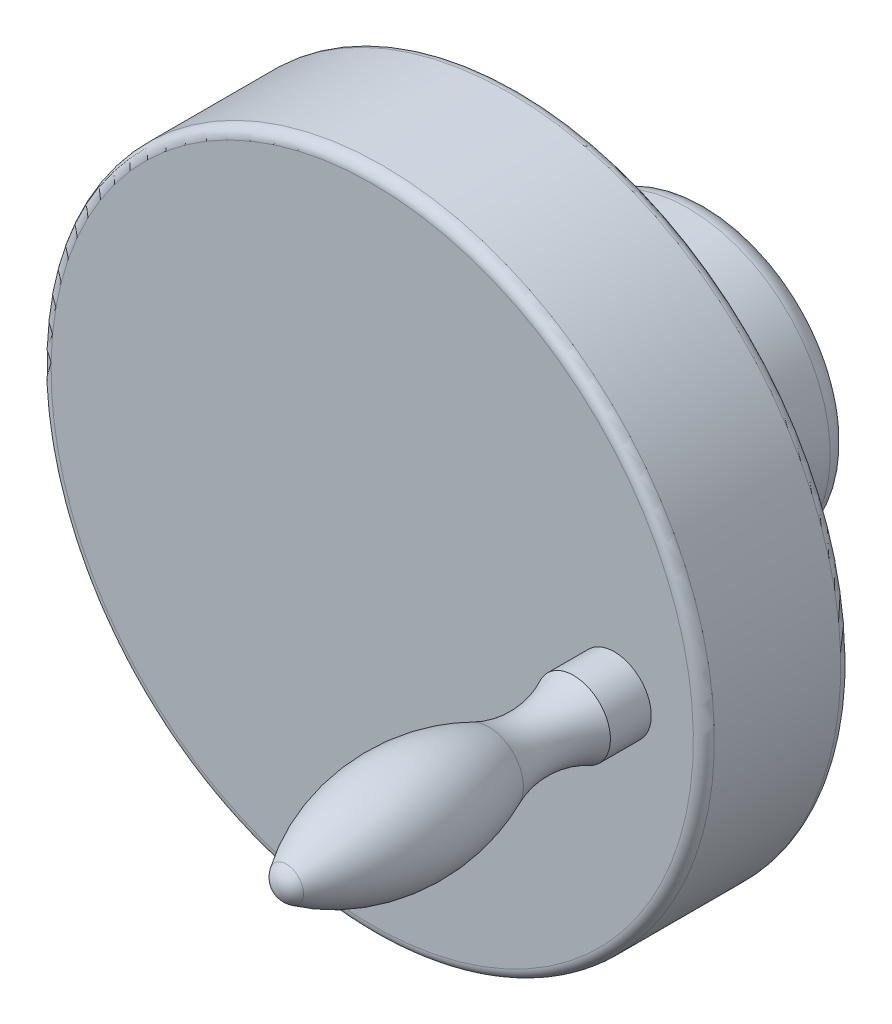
ISO-10303-21;
HEADER;
FILE_DESCRIPTION(('STEP AP214'),'2;1');
FILE_NAME('part.step','',(''),(''),'','','');
FILE_SCHEMA(('AUTOMOTIVE_DESIGN { 1 0 10303 214 1 1 1 1 }'));
ENDSEC;
DATA;
#1=APPLICATION_CONTEXT('core data for automotive mechanical design processes');
#2=APPLICATION_PROTOCOL_DEFINITION('international standard','automotive_design',2000,#1);
#3=PRODUCT_CONTEXT('',#1,'mechanical');
#4=PRODUCT('Part','Part','',(#3));
#5=PRODUCT_RELATED_PRODUCT_CATEGORY('part','',(#4));
#6=PRODUCT_DEFINITION_FORMATION('','',#4);
#7=PRODUCT_DEFINITION_CONTEXT('part definition',#1,'design');
#8=PRODUCT_DEFINITION('design','',#6,#7);
#9=PRODUCT_DEFINITION_SHAPE('','',#8);
#10=(LENGTH_UNIT() NAMED_UNIT(*) SI_UNIT(.MILLI.,.METRE.));
#11=(NAMED_UNIT(*) PLANE_ANGLE_UNIT() SI_UNIT($,.RADIAN.));
#12=(NAMED_UNIT(*) SI_UNIT($,.STERADIAN.) SOLID_ANGLE_UNIT());
#13=UNCERTAINTY_MEASURE_WITH_UNIT(LENGTH_MEASURE(1.E-05),#10,'distance_accuracy_value','');
#14=(GEOMETRIC_REPRESENTATION_CONTEXT(3) GLOBAL_UNCERTAINTY_ASSIGNED_CONTEXT((#13)) GLOBAL_UNIT_ASSIGNED_CONTEXT((#10,
#11,#12)) REPRESENTATION_CONTEXT('',''));
#15=CARTESIAN_POINT('',(0.,0.,0.));
#16=DIRECTION('',(0.,0.,1.));
#17=DIRECTION('',(1.,0.,0.));
#18=AXIS2_PLACEMENT_3D('',#15,#16,#17);
#19=CARTESIAN_POINT('',(0.,0.,32.));
#20=DIRECTION('',(0.,0.,1.));
#21=DIRECTION('',(0.,1.,0.));
#22=AXIS2_PLACEMENT_3D('',#19,#20,#21);
#23=PLANE('',#22);
#24=CARTESIAN_POINT('',(23.,0.,32.));
#25=DIRECTION('',(0.,0.,1.));
#26=DIRECTION('',(0.,1.,0.));
#27=AXIS2_PLACEMENT_3D('',#24,#25,#26);
#28=CIRCLE('',#27,3.50179345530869);
#29=CARTESIAN_POINT('',(23.,3.50179345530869,32.));
#30=VERTEX_POINT('',#29);
#31=EDGE_CURVE('E8',#30,#30,#28,.T.);
#32=ORIENTED_EDGE('',*,*,#31,.F.);
#33=EDGE_LOOP('',(#32));
#34=FACE_BOUND('',#33,.T.);
#35=CARTESIAN_POINT('',(0.,0.,32.));
#36=DIRECTION('',(0.,0.,1.));
#37=DIRECTION('',(0.,1.,0.));
#38=AXIS2_PLACEMENT_3D('',#35,#36,#37);
#39=CIRCLE('',#38,30.5);
#40=CARTESIAN_POINT('',(0.,30.5,32.));
#41=VERTEX_POINT('',#40);
#42=EDGE_CURVE('E18',#41,#41,#39,.T.);
#43=ORIENTED_EDGE('',*,*,#42,.T.);
#44=EDGE_LOOP('',(#43));
#45=FACE_BOUND('',#44,.T.);
#46=ADVANCED_FACE('F12',(#34,#45),#23,.T.);
#47=CARTESIAN_POINT('',(0.,0.,31.));
#48=DIRECTION('',(0.,0.,1.));
#49=DIRECTION('',(0.,1.,0.));
#50=AXIS2_PLACEMENT_3D('',#47,#48,#49);
#51=TOROIDAL_SURFACE('',#50,30.5,1.);
#52=CARTESIAN_POINT('',(0.,0.,31.));
#53=DIRECTION('',(0.,0.,1.));
#54=DIRECTION('',(0.,1.,0.));
#55=AXIS2_PLACEMENT_3D('',#52,#53,#54);
#56=CIRCLE('',#55,31.5);
#57=CARTESIAN_POINT('',(0.,31.5,31.));
#58=VERTEX_POINT('',#57);
#59=EDGE_CURVE('E22',#58,#58,#56,.T.);
#60=ORIENTED_EDGE('',*,*,#59,.T.);
#61=EDGE_LOOP('',(#60));
#62=FACE_BOUND('',#61,.T.);
#63=ORIENTED_EDGE('',*,*,#42,.F.);
#64=EDGE_LOOP('',(#63));
#65=FACE_BOUND('',#64,.T.);
#66=ADVANCED_FACE('F83',(#62,#65),#51,.T.);
#67=CARTESIAN_POINT('',(0.,0.,37.));
#68=DIRECTION('',(0.,0.,1.));
#69=DIRECTION('',(0.,1.,0.));
#70=AXIS2_PLACEMENT_3D('',#67,#68,#69);
#71=CYLINDRICAL_SURFACE('',#70,31.5);
#72=CARTESIAN_POINT('',(0.,0.,19.));
#73=DIRECTION('',(0.,0.,1.));
#74=DIRECTION('',(0.,1.,0.));
#75=AXIS2_PLACEMENT_3D('',#72,#73,#74);
#76=CIRCLE('',#75,31.5);
#77=CARTESIAN_POINT('',(0.,31.5,19.));
#78=VERTEX_POINT('',#77);
#79=EDGE_CURVE('E26',#78,#78,#76,.T.);
#80=ORIENTED_EDGE('',*,*,#79,.T.);
#81=EDGE_LOOP('',(#80));
#82=FACE_BOUND('',#81,.T.);
#83=ORIENTED_EDGE('',*,*,#59,.F.);
#84=EDGE_LOOP('',(#83));
#85=FACE_BOUND('',#84,.T.);
#86=ADVANCED_FACE('F88',(#82,#85),#71,.T.);
#87=CARTESIAN_POINT('',(0.,0.,19.));
#88=DIRECTION('',(0.,0.,1.));
#89=DIRECTION('',(0.,1.,0.));
#90=AXIS2_PLACEMENT_3D('',#87,#88,#89);
#91=TOROIDAL_SURFACE('',#90,30.5,1.00000000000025);
#92=CARTESIAN_POINT('',(0.,0.,18.));
#93=DIRECTION('',(0.,0.,1.));
#94=DIRECTION('',(0.,1.,0.));
#95=AXIS2_PLACEMENT_3D('',#92,#93,#94);
#96=CIRCLE('',#95,30.500001);
#97=CARTESIAN_POINT('',(0.,30.500001,18.));
#98=VERTEX_POINT('',#97);
#99=EDGE_CURVE('E31',#98,#98,#96,.T.);
#100=ORIENTED_EDGE('',*,*,#99,.T.);
#101=EDGE_LOOP('',(#100));
#102=FACE_BOUND('',#101,.T.);
#103=ORIENTED_EDGE('',*,*,#79,.F.);
#104=EDGE_LOOP('',(#103));
#105=FACE_BOUND('',#104,.T.);
#106=ADVANCED_FACE('F93',(#102,#105),#91,.T.);
#107=CARTESIAN_POINT('',(16.5,0.,18.));
#108=DIRECTION('',(0.,0.,1.));
#109=DIRECTION('',(0.,1.,0.));
#110=AXIS2_PLACEMENT_3D('',#107,#108,#109);
#111=PLANE('',#110);
#112=ORIENTED_EDGE('',*,*,#99,.F.);
#113=EDGE_LOOP('',(#112));
#114=FACE_BOUND('',#113,.T.);
#115=CARTESIAN_POINT('',(0.,0.,18.));
#116=DIRECTION('',(0.,0.,1.));
#117=DIRECTION('',(0.,1.,0.));
#118=AXIS2_PLACEMENT_3D('',#115,#116,#117);
#119=CIRCLE('',#118,16.5);
#120=CARTESIAN_POINT('',(0.,16.5,18.));
#121=VERTEX_POINT('',#120);
#122=EDGE_CURVE('E34',#121,#121,#119,.T.);
#123=ORIENTED_EDGE('',*,*,#122,.T.);
#124=EDGE_LOOP('',(#123));
#125=FACE_BOUND('',#124,.T.);
#126=ADVANCED_FACE('F100',(#114,#125),#111,.F.);
#127=CARTESIAN_POINT('',(0.,0.,15.));
#128=DIRECTION('',(0.,0.,1.));
#129=DIRECTION('',(0.,1.,0.));
#130=AXIS2_PLACEMENT_3D('',#127,#128,#129);
#131=TOROIDAL_SURFACE('',#130,16.5,3.);
#132=ORIENTED_EDGE('',*,*,#122,.F.);
#133=EDGE_LOOP('',(#132));
#134=FACE_BOUND('',#133,.T.);
#135=CARTESIAN_POINT('',(0.,0.,15.));
#136=DIRECTION('',(0.,0.,1.));
#137=DIRECTION('',(0.,1.,0.));
#138=AXIS2_PLACEMENT_3D('',#135,#136,#137);
#139=CIRCLE('',#138,13.5);
#140=CARTESIAN_POINT('',(0.,13.5,15.));
#141=VERTEX_POINT('',#140);
#142=EDGE_CURVE('E37',#141,#141,#139,.T.);
#143=ORIENTED_EDGE('',*,*,#142,.T.);
#144=EDGE_LOOP('',(#143));
#145=FACE_BOUND('',#144,.T.);
#146=ADVANCED_FACE('F104',(#134,#145),#131,.F.);
#147=CARTESIAN_POINT('',(0.,0.,37.));
#148=DIRECTION('',(0.,0.,1.));
#149=DIRECTION('',(0.,1.,0.));
#150=AXIS2_PLACEMENT_3D('',#147,#148,#149);
#151=CYLINDRICAL_SURFACE('',#150,13.5);
#152=CARTESIAN_POINT('',(0.,0.,2.));
#153=DIRECTION('',(0.,0.,1.));
#154=DIRECTION('',(0.,1.,0.));
#155=AXIS2_PLACEMENT_3D('',#152,#153,#154);
#156=CIRCLE('',#155,13.5);
#157=CARTESIAN_POINT('',(0.,13.5,2.));
#158=VERTEX_POINT('',#157);
#159=EDGE_CURVE('E40',#158,#158,#156,.T.);
#160=ORIENTED_EDGE('',*,*,#159,.T.);
#161=EDGE_LOOP('',(#160));
#162=FACE_BOUND('',#161,.T.);
#163=ORIENTED_EDGE('',*,*,#142,.F.);
#164=EDGE_LOOP('',(#163));
#165=FACE_BOUND('',#164,.T.);
#166=ADVANCED_FACE('F108',(#162,#165),#151,.T.);
#167=CARTESIAN_POINT('',(0.,0.,2.));
#168=DIRECTION('',(0.,0.,1.));
#169=DIRECTION('',(0.,1.,0.));
#170=AXIS2_PLACEMENT_3D('',#167,#168,#169);
#171=TOROIDAL_SURFACE('',#170,11.5,2.);
#172=CARTESIAN_POINT('',(0.,0.,0.));
#173=DIRECTION('',(0.,0.,1.));
#174=DIRECTION('',(0.,1.,0.));
#175=AXIS2_PLACEMENT_3D('',#172,#173,#174);
#176=CIRCLE('',#175,11.5);
#177=CARTESIAN_POINT('',(0.,11.5,0.));
#178=VERTEX_POINT('',#177);
#179=EDGE_CURVE('E43',#178,#178,#176,.T.);
#180=ORIENTED_EDGE('',*,*,#179,.T.);
#181=EDGE_LOOP('',(#180));
#182=FACE_BOUND('',#181,.T.);
#183=ORIENTED_EDGE('',*,*,#159,.F.);
#184=EDGE_LOOP('',(#183));
#185=FACE_BOUND('',#184,.T.);
#186=ADVANCED_FACE('F78',(#182,#185),#171,.T.);
#187=CARTESIAN_POINT('',(2.5,0.,0.));
#188=DIRECTION('',(0.,0.,1.));
#189=DIRECTION('',(0.,1.,0.));
#190=AXIS2_PLACEMENT_3D('',#187,#188,#189);
#191=PLANE('',#190);
#192=ORIENTED_EDGE('',*,*,#179,.F.);
#193=EDGE_LOOP('',(#192));
#194=FACE_BOUND('',#193,.T.);
#195=CARTESIAN_POINT('',(0.,0.,0.));
#196=DIRECTION('',(0.,0.,1.));
#197=DIRECTION('',(0.,1.,0.));
#198=AXIS2_PLACEMENT_3D('',#195,#196,#197);
#199=CIRCLE('',#198,2.5);
#200=CARTESIAN_POINT('',(0.,2.5,0.));
#201=VERTEX_POINT('',#200);
#202=EDGE_CURVE('E46',#201,#201,#199,.T.);
#203=ORIENTED_EDGE('',*,*,#202,.T.);
#204=EDGE_LOOP('',(#203));
#205=FACE_BOUND('',#204,.T.);
#206=ADVANCED_FACE('F67',(#194,#205),#191,.F.);
#207=CARTESIAN_POINT('',(0.,0.,37.));
#208=DIRECTION('',(0.,0.,1.));
#209=DIRECTION('',(0.,1.,0.));
#210=AXIS2_PLACEMENT_3D('',#207,#208,#209);
#211=CYLINDRICAL_SURFACE('',#210,2.5);
#212=ORIENTED_EDGE('',*,*,#202,.F.);
#213=EDGE_LOOP('',(#212));
#214=FACE_BOUND('',#213,.T.);
#215=CARTESIAN_POINT('',(0.,0.,15.));
#216=DIRECTION('',(0.,0.,-1.));
#217=DIRECTION('',(0.,1.,0.));
#218=AXIS2_PLACEMENT_3D('',#215,#216,#217);
#219=CIRCLE('',#218,2.5);
#220=CARTESIAN_POINT('',(0.,2.5,15.));
#221=VERTEX_POINT('',#220);
#222=EDGE_CURVE('E58',#221,#221,#219,.T.);
#223=ORIENTED_EDGE('',*,*,#222,.F.);
#224=EDGE_LOOP('',(#223));
#225=FACE_BOUND('',#224,.T.);
#226=ADVANCED_FACE('F64',(#214,#225),#211,.F.);
#227=CARTESIAN_POINT('',(23.,0.,40.1211991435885));
#228=DIRECTION('',(0.,0.,1.));
#229=DIRECTION('',(0.,1.,0.));
#230=AXIS2_PLACEMENT_3D('',#227,#228,#229);
#231=TOROIDAL_SURFACE('',#230,12.0017934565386,9.5);
#232=CARTESIAN_POINT('',(23.,0.,43.9472159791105));
#233=DIRECTION('',(0.,0.,1.));
#234=DIRECTION('',(0.,1.,0.));
#235=AXIS2_PLACEMENT_3D('',#232,#233,#234);
#236=CIRCLE('',#235,3.30630064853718);
#237=CARTESIAN_POINT('',(23.,3.30630064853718,43.9472159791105));
#238=VERTEX_POINT('',#237);
#239=EDGE_CURVE('E55',#238,#238,#236,.T.);
#240=ORIENTED_EDGE('',*,*,#239,.F.);
#241=EDGE_LOOP('',(#240));
#242=FACE_BOUND('',#241,.T.);
#243=CARTESIAN_POINT('',(23.,0.,35.8785584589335));
#244=DIRECTION('',(0.,0.,1.));
#245=DIRECTION('',(0.,1.,0.));
#246=AXIS2_PLACEMENT_3D('',#243,#244,#245);
#247=CIRCLE('',#246,3.50179345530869);
#248=CARTESIAN_POINT('',(23.,3.50179345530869,35.8785584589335));
#249=VERTEX_POINT('',#248);
#250=EDGE_CURVE('E49',#249,#249,#247,.T.);
#251=ORIENTED_EDGE('',*,*,#250,.T.);
#252=EDGE_LOOP('',(#251));
#253=FACE_BOUND('',#252,.T.);
#254=ADVANCED_FACE('F66',(#242,#253),#231,.F.);
#255=CARTESIAN_POINT('',(23.,0.,69.));
#256=DIRECTION('',(0.,0.,1.));
#257=DIRECTION('',(0.,1.,0.));
#258=AXIS2_PLACEMENT_3D('',#255,#256,#257);
#259=CYLINDRICAL_SURFACE('',#258,3.50179345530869);
#260=ORIENTED_EDGE('',*,*,#31,.T.);
#261=EDGE_LOOP('',(#260));
#262=FACE_BOUND('',#261,.T.);
#263=ORIENTED_EDGE('',*,*,#250,.F.);
#264=EDGE_LOOP('',(#263));
#265=FACE_BOUND('',#264,.T.);
#266=ADVANCED_FACE('F75',(#262,#265),#259,.T.);
#267=CARTESIAN_POINT('',(23.,0.,62.06));
#268=DIRECTION('',(0.,1.,0.));
#269=DIRECTION('',(0.,0.,-1.));
#270=AXIS2_PLACEMENT_3D('',#267,#268,#269);
#271=SPHERICAL_SURFACE('',#270,1.93999999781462);
#272=CARTESIAN_POINT('',(23.,0.,62.06));
#273=DIRECTION('',(0.,0.,1.));
#274=DIRECTION('',(0.,1.,0.));
#275=AXIS2_PLACEMENT_3D('',#272,#273,#274);
#276=SPHERICAL_SURFACE('',#275,1.93999999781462);
#277=CARTESIAN_POINT('',(23.,0.,63.140428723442));
#278=DIRECTION('',(0.,0.,1.));
#279=DIRECTION('',(0.,1.,0.));
#280=AXIS2_PLACEMENT_3D('',#277,#278,#279);
#281=CIRCLE('',#280,1.61129567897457);
#282=CARTESIAN_POINT('',(23.,1.61129567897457,63.140428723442));
#283=VERTEX_POINT('',#282);
#284=EDGE_CURVE('E52',#283,#283,#281,.T.);
#285=ORIENTED_EDGE('',*,*,#284,.T.);
#286=EDGE_LOOP('',(#285));
#287=FACE_BOUND('',#286,.T.);
#288=ADVANCED_FACE('F154',(#287),#276,.T.);
#289=CARTESIAN_POINT('',(23.,0.,52.001988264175));
#290=DIRECTION('',(0.,0.,1.));
#291=DIRECTION('',(0.,1.,0.));
#292=AXIS2_PLACEMENT_3D('',#289,#290,#291);
#293=DEGENERATE_TOROIDAL_SURFACE('',#292,14.9999999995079,19.9999999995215,.F.);
#294=ORIENTED_EDGE('',*,*,#239,.T.);
#295=EDGE_LOOP('',(#294));
#296=FACE_BOUND('',#295,.T.);
#297=ORIENTED_EDGE('',*,*,#284,.F.);
#298=EDGE_LOOP('',(#297));
#299=FACE_BOUND('',#298,.T.);
#300=ADVANCED_FACE('F163',(#296,#299),#293,.F.);
#301=CARTESIAN_POINT('',(0.,0.,15.));
#302=DIRECTION('',(0.,0.,-1.));
#303=DIRECTION('',(0.,1.,0.));
#304=AXIS2_PLACEMENT_3D('',#301,#302,#303);
#305=PLANE('',#304);
#306=ORIENTED_EDGE('',*,*,#222,.T.);
#307=EDGE_LOOP('',(#306));
#308=FACE_BOUND('',#307,.T.);
#309=ADVANCED_FACE('F62',(#308),#305,.T.);
#310=CLOSED_SHELL('',(#46,#66,#86,#106,#126,#146,#166,#186,#206,#226,#254,#266,#288,#300,#309));
#311=MANIFOLD_SOLID_BREP('B1',#310);
#312=ADVANCED_BREP_SHAPE_REPRESENTATION('',(#18,#311),#14);
#313=SHAPE_DEFINITION_REPRESENTATION(#9,#312);
ENDSEC;
END-ISO-10303-21;
